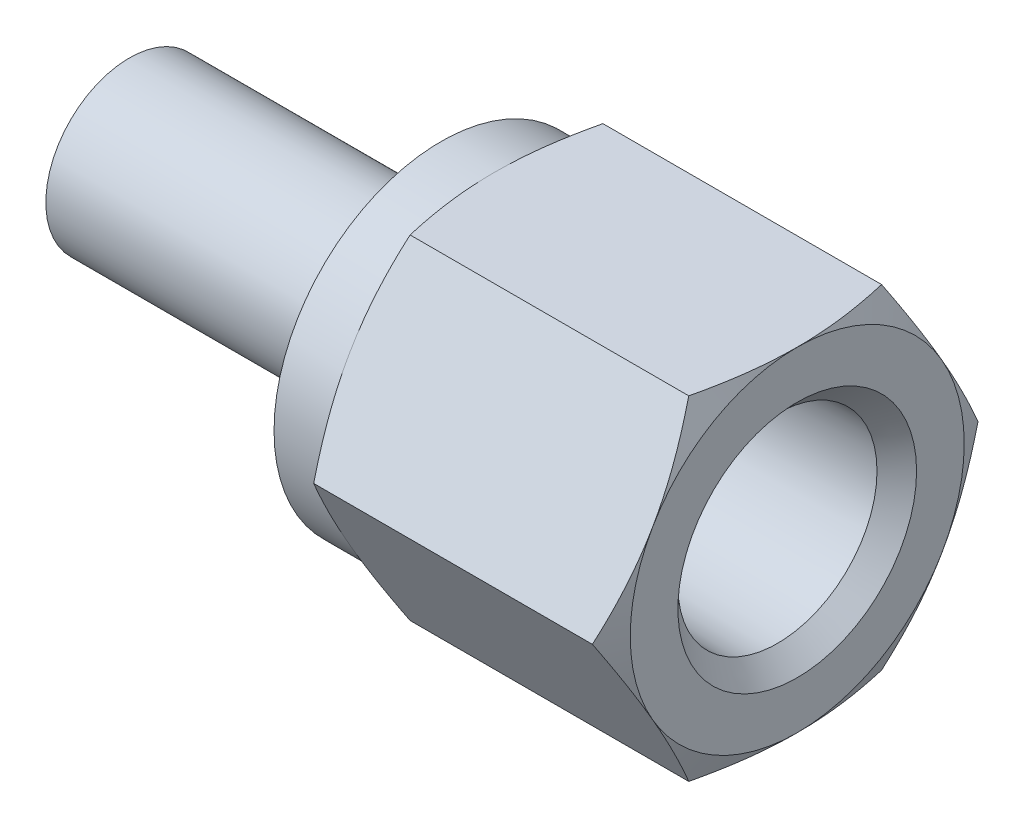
ISO-10303-21;
HEADER;
FILE_DESCRIPTION(('STEP AP214'),'2;1');
FILE_NAME('part.step','',(''),(''),'','','');
FILE_SCHEMA(('AUTOMOTIVE_DESIGN { 1 0 10303 214 1 1 1 1 }'));
ENDSEC;
DATA;
#1=APPLICATION_CONTEXT('core data for automotive mechanical design processes');
#2=APPLICATION_PROTOCOL_DEFINITION('international standard','automotive_design',2000,#1);
#3=PRODUCT_CONTEXT('',#1,'mechanical');
#4=PRODUCT('Part','Part','',(#3));
#5=PRODUCT_RELATED_PRODUCT_CATEGORY('part','',(#4));
#6=PRODUCT_DEFINITION_FORMATION('','',#4);
#7=PRODUCT_DEFINITION_CONTEXT('part definition',#1,'design');
#8=PRODUCT_DEFINITION('design','',#6,#7);
#9=PRODUCT_DEFINITION_SHAPE('','',#8);
#10=(LENGTH_UNIT() NAMED_UNIT(*) SI_UNIT(.MILLI.,.METRE.));
#11=(NAMED_UNIT(*) PLANE_ANGLE_UNIT() SI_UNIT($,.RADIAN.));
#12=(NAMED_UNIT(*) SI_UNIT($,.STERADIAN.) SOLID_ANGLE_UNIT());
#13=UNCERTAINTY_MEASURE_WITH_UNIT(LENGTH_MEASURE(1.E-05),#10,'distance_accuracy_value','');
#14=(GEOMETRIC_REPRESENTATION_CONTEXT(3) GLOBAL_UNCERTAINTY_ASSIGNED_CONTEXT((#13)) GLOBAL_UNIT_ASSIGNED_CONTEXT((#10,
#11,#12)) REPRESENTATION_CONTEXT('',''));
#15=CARTESIAN_POINT('',(0.,0.,0.));
#16=DIRECTION('',(0.,0.,1.));
#17=DIRECTION('',(1.,0.,0.));
#18=AXIS2_PLACEMENT_3D('',#15,#16,#17);
#19=CARTESIAN_POINT('',(38.0999999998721,0.,0.));
#20=DIRECTION('',(1.,0.,0.));
#21=DIRECTION('',(0.,0.,-1.));
#22=AXIS2_PLACEMENT_3D('',#19,#20,#21);
#23=CONICAL_SURFACE('',#22,6.80808899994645,0.785398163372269);
#24=CARTESIAN_POINT('',(38.099999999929,0.,0.));
#25=DIRECTION('',(1.,0.,0.));
#26=DIRECTION('',(0.,0.,-1.));
#27=AXIS2_PLACEMENT_3D('',#24,#25,#26);
#28=CIRCLE('',#27,6.80808900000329);
#29=CARTESIAN_POINT('',(38.099999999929,0.,-6.80808900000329));
#30=VERTEX_POINT('',#29);
#31=EDGE_CURVE('E19',#30,#30,#28,.T.);
#32=ORIENTED_EDGE('',*,*,#31,.T.);
#33=EDGE_LOOP('',(#32));
#34=FACE_BOUND('',#33,.T.);
#35=CARTESIAN_POINT('',(36.9712240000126,0.,0.));
#36=DIRECTION('',(1.,0.,0.));
#37=DIRECTION('',(0.,0.,-1.));
#38=AXIS2_PLACEMENT_3D('',#35,#36,#37);
#39=CIRCLE('',#38,5.67931299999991);
#40=CARTESIAN_POINT('',(36.9712240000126,0.,-5.67931299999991));
#41=VERTEX_POINT('',#40);
#42=EDGE_CURVE('E124',#41,#41,#39,.F.);
#43=ORIENTED_EDGE('',*,*,#42,.T.);
#44=EDGE_LOOP('',(#43));
#45=FACE_BOUND('',#44,.T.);
#46=ADVANCED_FACE('F16',(#34,#45),#23,.F.);
#47=CARTESIAN_POINT('',(38.1,0.,0.));
#48=DIRECTION('',(-1.,0.,0.));
#49=DIRECTION('',(0.,-1.,0.));
#50=AXIS2_PLACEMENT_3D('',#47,#48,#49);
#51=PLANE('',#50);
#52=CARTESIAN_POINT('',(38.1,0.,0.));
#53=DIRECTION('',(-1.,0.,0.));
#54=DIRECTION('',(0.,-1.,0.));
#55=AXIS2_PLACEMENT_3D('',#52,#53,#54);
#56=CIRCLE('',#55,9.525);
#57=CARTESIAN_POINT('',(38.1,-4.7625,8.24889197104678));
#58=VERTEX_POINT('',#57);
#59=CARTESIAN_POINT('',(38.1,-9.525,0.));
#60=VERTEX_POINT('',#59);
#61=EDGE_CURVE('E106',#58,#60,#56,.F.);
#62=ORIENTED_EDGE('',*,*,#61,.T.);
#63=CARTESIAN_POINT('',(38.1,0.,0.));
#64=DIRECTION('',(-1.,0.,0.));
#65=DIRECTION('',(0.,-1.,0.));
#66=AXIS2_PLACEMENT_3D('',#63,#64,#65);
#67=CIRCLE('',#66,9.525);
#68=CARTESIAN_POINT('',(38.1,-4.7625,-8.24889197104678));
#69=VERTEX_POINT('',#68);
#70=EDGE_CURVE('E469',#60,#69,#67,.F.);
#71=ORIENTED_EDGE('',*,*,#70,.T.);
#72=CARTESIAN_POINT('',(38.1,0.,0.));
#73=DIRECTION('',(-1.,0.,0.));
#74=DIRECTION('',(0.,-1.,0.));
#75=AXIS2_PLACEMENT_3D('',#72,#73,#74);
#76=CIRCLE('',#75,9.52500000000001);
#77=CARTESIAN_POINT('',(38.1,4.76250000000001,-8.24889197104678));
#78=VERTEX_POINT('',#77);
#79=EDGE_CURVE('E471',#69,#78,#76,.F.);
#80=ORIENTED_EDGE('',*,*,#79,.T.);
#81=CARTESIAN_POINT('',(38.1,0.,0.));
#82=DIRECTION('',(-1.,0.,0.));
#83=DIRECTION('',(0.,-1.,0.));
#84=AXIS2_PLACEMENT_3D('',#81,#82,#83);
#85=CIRCLE('',#84,9.525);
#86=CARTESIAN_POINT('',(38.1,9.525,0.));
#87=VERTEX_POINT('',#86);
#88=EDGE_CURVE('E397',#78,#87,#85,.F.);
#89=ORIENTED_EDGE('',*,*,#88,.T.);
#90=CARTESIAN_POINT('',(38.1,0.,0.));
#91=DIRECTION('',(-1.,0.,0.));
#92=DIRECTION('',(0.,-1.,0.));
#93=AXIS2_PLACEMENT_3D('',#90,#91,#92);
#94=CIRCLE('',#93,9.525);
#95=CARTESIAN_POINT('',(38.1,4.7625,8.24889197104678));
#96=VERTEX_POINT('',#95);
#97=EDGE_CURVE('E109',#87,#96,#94,.F.);
#98=ORIENTED_EDGE('',*,*,#97,.T.);
#99=CARTESIAN_POINT('',(38.1,0.,0.));
#100=DIRECTION('',(-1.,0.,0.));
#101=DIRECTION('',(0.,-1.,0.));
#102=AXIS2_PLACEMENT_3D('',#99,#100,#101);
#103=CIRCLE('',#102,9.525);
#104=EDGE_CURVE('E102',#96,#58,#103,.F.);
#105=ORIENTED_EDGE('',*,*,#104,.T.);
#106=EDGE_LOOP('',(#62,#71,#80,#89,#98,#105));
#107=FACE_BOUND('',#106,.T.);
#108=ORIENTED_EDGE('',*,*,#31,.F.);
#109=EDGE_LOOP('',(#108));
#110=FACE_BOUND('',#109,.T.);
#111=ADVANCED_FACE('F104',(#107,#110),#51,.F.);
#112=CARTESIAN_POINT('',(36.9712240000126,0.,0.));
#113=DIRECTION('',(1.,0.,0.));
#114=DIRECTION('',(0.,0.,-1.));
#115=AXIS2_PLACEMENT_3D('',#112,#113,#114);
#116=CONICAL_SURFACE('',#115,5.67931299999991,0.0256563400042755);
#117=ORIENTED_EDGE('',*,*,#42,.F.);
#118=EDGE_LOOP('',(#117));
#119=FACE_BOUND('',#118,.T.);
#120=CARTESIAN_POINT('',(28.0796999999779,0.,0.));
#121=DIRECTION('',(1.,0.,0.));
#122=DIRECTION('',(0.,0.,-1.));
#123=AXIS2_PLACEMENT_3D('',#120,#121,#122);
#124=CIRCLE('',#123,5.45113896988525);
#125=CARTESIAN_POINT('',(28.0796999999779,0.,-5.45113896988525));
#126=VERTEX_POINT('',#125);
#127=EDGE_CURVE('E466',#126,#126,#124,.F.);
#128=ORIENTED_EDGE('',*,*,#127,.T.);
#129=EDGE_LOOP('',(#128));
#130=FACE_BOUND('',#129,.T.);
#131=ADVANCED_FACE('F696',(#119,#130),#116,.F.);
#132=CARTESIAN_POINT('',(38.1,0.,0.));
#133=DIRECTION('',(-1.,0.,0.));
#134=DIRECTION('',(0.,-1.,0.));
#135=AXIS2_PLACEMENT_3D('',#132,#133,#134);
#136=CONICAL_SURFACE('',#135,9.525,1.13446401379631);
#137=ORIENTED_EDGE('',*,*,#61,.F.);
#138=CARTESIAN_POINT('',(37.4128851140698,-9.525,5.49926131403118));
#139=CARTESIAN_POINT('',(37.5181207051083,-9.13425586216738,5.72485754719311));
#140=CARTESIAN_POINT('',(37.6141598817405,-8.74140643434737,5.95166927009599));
#141=CARTESIAN_POINT('',(37.783216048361,-7.95340642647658,6.40662128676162));
#142=CARTESIAN_POINT('',(37.8563093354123,-7.55826801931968,6.63475455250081));
#143=CARTESIAN_POINT('',(37.9458100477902,-6.9631220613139,6.97836223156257));
#144=CARTESIAN_POINT('',(37.9722940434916,-6.7642487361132,7.09318179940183));
#145=CARTESIAN_POINT('',(38.018085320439,-6.3658813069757,7.32317934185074));
#146=CARTESIAN_POINT('',(38.0373927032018,-6.16638721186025,7.43835731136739));
#147=CARTESIAN_POINT('',(38.0685075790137,-5.76628908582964,7.66935407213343));
#148=CARTESIAN_POINT('',(38.0802898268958,-5.56568357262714,7.78517371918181));
#149=CARTESIAN_POINT('',(38.0960502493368,-5.16422061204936,8.01695846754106));
#150=CARTESIAN_POINT('',(38.1000275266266,-4.96336313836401,8.13292358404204));
#151=CARTESIAN_POINT('',(38.1,-4.7625,8.24889197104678));
#152=B_SPLINE_CURVE_WITH_KNOTS('',3,(#138,#139,#140,#141,#142,#143,#144,#145,#146,#147,#148,
#149,#150,#151),.UNSPECIFIED.,.F.,.F.,(4,2,2,2,2,2,4),(0.,1.39025784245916,2.77584275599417,
3.46922419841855,4.16259583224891,4.85828152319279,5.55404718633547),.UNSPECIFIED.);
#153=CARTESIAN_POINT('',(37.4128851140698,-9.525,5.49926131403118));
#154=VERTEX_POINT('',#153);
#155=EDGE_CURVE('E120',#154,#58,#152,.T.);
#156=ORIENTED_EDGE('',*,*,#155,.F.);
#157=CARTESIAN_POINT('',(38.1,-9.525,0.));
#158=CARTESIAN_POINT('',(38.1000275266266,-9.525,0.231936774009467));
#159=CARTESIAN_POINT('',(38.0960502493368,-9.525,0.463867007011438));
#160=CARTESIAN_POINT('',(38.0802898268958,-9.525,0.927436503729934));
#161=CARTESIAN_POINT('',(38.0685075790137,-9.525,1.1590757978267));
#162=CARTESIAN_POINT('',(38.0373927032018,-9.525,1.62106931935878));
#163=CARTESIAN_POINT('',(38.018085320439,-9.525,1.85142525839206));
#164=CARTESIAN_POINT('',(37.9722940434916,-9.525,2.31142034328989));
#165=CARTESIAN_POINT('',(37.9458100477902,-9.525,2.54105947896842));
#166=CARTESIAN_POINT('',(37.8563093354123,-9.525,3.22827483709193));
#167=CARTESIAN_POINT('',(37.783216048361,-9.525,3.68454136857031));
#168=CARTESIAN_POINT('',(37.6141598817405,-9.525,4.59444540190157));
#169=CARTESIAN_POINT('',(37.5181207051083,-9.525,5.04806884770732));
#170=CARTESIAN_POINT('',(37.4128851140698,-9.525,5.49926131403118));
#171=B_SPLINE_CURVE_WITH_KNOTS('',3,(#157,#158,#159,#160,#161,#162,#163,#164,#165,#166,#167,
#168,#169,#170),.UNSPECIFIED.,.F.,.F.,(4,2,2,2,2,2,4),(0.,0.695765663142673,1.39145135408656,
2.08482298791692,2.77820443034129,4.1637893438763,5.55404718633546),.UNSPECIFIED.);
#172=EDGE_CURVE('E122',#60,#154,#171,.T.);
#173=ORIENTED_EDGE('',*,*,#172,.F.);
#174=EDGE_LOOP('',(#137,#156,#173));
#175=FACE_BOUND('',#174,.T.);
#176=ADVANCED_FACE('F118',(#175),#136,.T.);
#177=CARTESIAN_POINT('',(38.1,0.,0.));
#178=DIRECTION('',(-1.,0.,0.));
#179=DIRECTION('',(0.,-1.,0.));
#180=AXIS2_PLACEMENT_3D('',#177,#178,#179);
#181=CONICAL_SURFACE('',#180,9.525,1.13446401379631);
#182=ORIENTED_EDGE('',*,*,#104,.F.);
#183=CARTESIAN_POINT('',(37.4128851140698,0.,10.9985226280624));
#184=CARTESIAN_POINT('',(37.5181207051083,0.390744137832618,10.7729263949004));
#185=CARTESIAN_POINT('',(37.6141598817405,0.783593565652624,10.5461146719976));
#186=CARTESIAN_POINT('',(37.783216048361,1.57159357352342,10.0911626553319));
#187=CARTESIAN_POINT('',(37.8563093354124,1.96673198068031,9.86302938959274));
#188=CARTESIAN_POINT('',(37.9458100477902,2.56187793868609,9.51942171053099));
#189=CARTESIAN_POINT('',(37.9722940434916,2.7607512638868,9.40460214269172));
#190=CARTESIAN_POINT('',(38.018085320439,3.1591186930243,9.17460460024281));
#191=CARTESIAN_POINT('',(38.0373927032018,3.35861278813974,9.05942663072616));
#192=CARTESIAN_POINT('',(38.0685075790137,3.75871091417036,8.82842986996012));
#193=CARTESIAN_POINT('',(38.0802898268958,3.95931642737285,8.71261022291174));
#194=CARTESIAN_POINT('',(38.0960502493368,4.36077938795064,8.48082547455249));
#195=CARTESIAN_POINT('',(38.1000275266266,4.56163686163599,8.36486035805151));
#196=CARTESIAN_POINT('',(38.1,4.7625,8.24889197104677));
#197=B_SPLINE_CURVE_WITH_KNOTS('',3,(#183,#184,#185,#186,#187,#188,#189,#190,#191,#192,#193,
#194,#195,#196),.UNSPECIFIED.,.F.,.F.,(4,2,2,2,2,2,4),(0.,1.39025784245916,2.77584275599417,
3.46922419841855,4.16259583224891,4.85828152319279,5.55404718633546),.UNSPECIFIED.);
#198=CARTESIAN_POINT('',(37.4128851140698,0.,10.9985226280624));
#199=VERTEX_POINT('',#198);
#200=EDGE_CURVE('E128',#199,#96,#197,.T.);
#201=ORIENTED_EDGE('',*,*,#200,.F.);
#202=CARTESIAN_POINT('',(38.1,-4.7625,8.24889197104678));
#203=CARTESIAN_POINT('',(38.1000275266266,-4.56163686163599,8.36486035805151));
#204=CARTESIAN_POINT('',(38.0960502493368,-4.36077938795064,8.4808254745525));
#205=CARTESIAN_POINT('',(38.0802898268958,-3.95931642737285,8.71261022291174));
#206=CARTESIAN_POINT('',(38.0685075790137,-3.75871091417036,8.82842986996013));
#207=CARTESIAN_POINT('',(38.0373927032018,-3.35861278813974,9.05942663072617));
#208=CARTESIAN_POINT('',(38.018085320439,-3.1591186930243,9.17460460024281));
#209=CARTESIAN_POINT('',(37.9722940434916,-2.7607512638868,9.40460214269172));
#210=CARTESIAN_POINT('',(37.9458100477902,-2.5618779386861,9.51942171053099));
#211=CARTESIAN_POINT('',(37.8563093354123,-1.96673198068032,9.86302938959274));
#212=CARTESIAN_POINT('',(37.783216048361,-1.57159357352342,10.0911626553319));
#213=CARTESIAN_POINT('',(37.6141598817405,-0.783593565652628,10.5461146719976));
#214=CARTESIAN_POINT('',(37.5181207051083,-0.390744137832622,10.7729263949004));
#215=CARTESIAN_POINT('',(37.4128851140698,0.,10.9985226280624));
#216=B_SPLINE_CURVE_WITH_KNOTS('',3,(#202,#203,#204,#205,#206,#207,#208,#209,#210,#211,#212,
#213,#214,#215),.UNSPECIFIED.,.F.,.F.,(4,2,2,2,2,2,4),(0.,0.695765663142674,1.39145135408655,
2.08482298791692,2.77820443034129,4.1637893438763,5.55404718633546),.UNSPECIFIED.);
#217=EDGE_CURVE('E125',#58,#199,#216,.T.);
#218=ORIENTED_EDGE('',*,*,#217,.F.);
#219=EDGE_LOOP('',(#182,#201,#218));
#220=FACE_BOUND('',#219,.T.);
#221=ADVANCED_FACE('F126',(#220),#181,.T.);
#222=CARTESIAN_POINT('',(38.1,0.,0.));
#223=DIRECTION('',(-1.,0.,0.));
#224=DIRECTION('',(0.,-1.,0.));
#225=AXIS2_PLACEMENT_3D('',#222,#223,#224);
#226=CONICAL_SURFACE('',#225,9.525,1.13446401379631);
#227=CARTESIAN_POINT('',(38.1,4.7625,8.24889197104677));
#228=CARTESIAN_POINT('',(38.1000275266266,4.96336313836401,8.13292358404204));
#229=CARTESIAN_POINT('',(38.0960502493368,5.16422061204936,8.01695846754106));
#230=CARTESIAN_POINT('',(38.0802898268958,5.56568357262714,7.78517371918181));
#231=CARTESIAN_POINT('',(38.0685075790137,5.76628908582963,7.66935407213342));
#232=CARTESIAN_POINT('',(38.0373927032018,6.16638721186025,7.43835731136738));
#233=CARTESIAN_POINT('',(38.018085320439,6.36588130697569,7.32317934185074));
#234=CARTESIAN_POINT('',(37.9722940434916,6.76424873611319,7.09318179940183));
#235=CARTESIAN_POINT('',(37.9458100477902,6.9631220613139,6.97836223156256));
#236=CARTESIAN_POINT('',(37.8563093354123,7.55826801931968,6.63475455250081));
#237=CARTESIAN_POINT('',(37.783216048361,7.95340642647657,6.40662128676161));
#238=CARTESIAN_POINT('',(37.6141598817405,8.74140643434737,5.95166927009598));
#239=CARTESIAN_POINT('',(37.5181207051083,9.13425586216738,5.72485754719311));
#240=CARTESIAN_POINT('',(37.4128851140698,9.52499999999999,5.49926131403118));
#241=B_SPLINE_CURVE_WITH_KNOTS('',3,(#227,#228,#229,#230,#231,#232,#233,#234,#235,#236,#237,
#238,#239,#240),.UNSPECIFIED.,.F.,.F.,(4,2,2,2,2,2,4),(0.,0.695765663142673,1.39145135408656,
2.08482298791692,2.77820443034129,4.1637893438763,5.55404718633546),.UNSPECIFIED.);
#242=CARTESIAN_POINT('',(37.4128851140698,9.52499999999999,5.49926131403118));
#243=VERTEX_POINT('',#242);
#244=EDGE_CURVE('E333',#96,#243,#241,.T.);
#245=ORIENTED_EDGE('',*,*,#244,.F.);
#246=ORIENTED_EDGE('',*,*,#97,.F.);
#247=CARTESIAN_POINT('',(37.4128851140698,9.52499999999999,5.49926131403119));
#248=CARTESIAN_POINT('',(37.5181207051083,9.52499999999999,5.04806884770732));
#249=CARTESIAN_POINT('',(37.6141598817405,9.52499999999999,4.59444540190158));
#250=CARTESIAN_POINT('',(37.783216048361,9.52499999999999,3.68454136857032));
#251=CARTESIAN_POINT('',(37.8563093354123,9.52499999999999,3.22827483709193));
#252=CARTESIAN_POINT('',(37.9458100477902,9.52499999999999,2.54105947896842));
#253=CARTESIAN_POINT('',(37.9722940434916,9.52499999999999,2.3114203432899));
#254=CARTESIAN_POINT('',(38.018085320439,9.52499999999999,1.85142525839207));
#255=CARTESIAN_POINT('',(38.0373927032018,9.52499999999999,1.62106931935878));
#256=CARTESIAN_POINT('',(38.0685075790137,9.52499999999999,1.1590757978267));
#257=CARTESIAN_POINT('',(38.0802898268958,9.52499999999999,0.927436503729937));
#258=CARTESIAN_POINT('',(38.0960502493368,9.52499999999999,0.46386700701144));
#259=CARTESIAN_POINT('',(38.1000275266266,9.52499999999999,0.231936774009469));
#260=CARTESIAN_POINT('',(38.1,9.52499999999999,0.));
#261=B_SPLINE_CURVE_WITH_KNOTS('',3,(#247,#248,#249,#250,#251,#252,#253,#254,#255,#256,#257,
#258,#259,#260),.UNSPECIFIED.,.F.,.F.,(4,2,2,2,2,2,4),(0.,1.39025784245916,2.77584275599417,
3.46922419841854,4.16259583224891,4.85828152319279,5.55404718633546),.UNSPECIFIED.);
#262=EDGE_CURVE('E310',#243,#87,#261,.T.);
#263=ORIENTED_EDGE('',*,*,#262,.F.);
#264=EDGE_LOOP('',(#245,#246,#263));
#265=FACE_BOUND('',#264,.T.);
#266=ADVANCED_FACE('F324',(#265),#226,.T.);
#267=CARTESIAN_POINT('',(38.1,0.,0.));
#268=DIRECTION('',(-1.,0.,0.));
#269=DIRECTION('',(0.,-1.,0.));
#270=AXIS2_PLACEMENT_3D('',#267,#268,#269);
#271=CONICAL_SURFACE('',#270,9.525,1.13446401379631);
#272=CARTESIAN_POINT('',(38.1,9.52499999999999,0.));
#273=CARTESIAN_POINT('',(38.1000275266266,9.52499999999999,-0.231936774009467));
#274=CARTESIAN_POINT('',(38.0960502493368,9.52499999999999,-0.463867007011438));
#275=CARTESIAN_POINT('',(38.0802898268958,9.52499999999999,-0.927436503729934));
#276=CARTESIAN_POINT('',(38.0685075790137,9.52499999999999,-1.1590757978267));
#277=CARTESIAN_POINT('',(38.0373927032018,9.52499999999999,-1.62106931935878));
#278=CARTESIAN_POINT('',(38.018085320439,9.52499999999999,-1.85142525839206));
#279=CARTESIAN_POINT('',(37.9722940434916,9.52499999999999,-2.31142034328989));
#280=CARTESIAN_POINT('',(37.9458100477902,9.52499999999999,-2.54105947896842));
#281=CARTESIAN_POINT('',(37.8563093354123,9.52499999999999,-3.22827483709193));
#282=CARTESIAN_POINT('',(37.783216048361,9.52499999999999,-3.68454136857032));
#283=CARTESIAN_POINT('',(37.6141598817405,9.52499999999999,-4.59444540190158));
#284=CARTESIAN_POINT('',(37.5181207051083,9.52499999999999,-5.04806884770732));
#285=CARTESIAN_POINT('',(37.4128851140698,9.52499999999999,-5.49926131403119));
#286=B_SPLINE_CURVE_WITH_KNOTS('',3,(#272,#273,#274,#275,#276,#277,#278,#279,#280,#281,#282,
#283,#284,#285),.UNSPECIFIED.,.F.,.F.,(4,2,2,2,2,2,4),(0.,0.695765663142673,1.39145135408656,
2.08482298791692,2.77820443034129,4.1637893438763,5.55404718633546),.UNSPECIFIED.);
#287=CARTESIAN_POINT('',(37.4128851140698,9.525,-5.49926131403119));
#288=VERTEX_POINT('',#287);
#289=EDGE_CURVE('E303',#87,#288,#286,.T.);
#290=ORIENTED_EDGE('',*,*,#289,.F.);
#291=ORIENTED_EDGE('',*,*,#88,.F.);
#292=CARTESIAN_POINT('',(37.4128851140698,9.52499999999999,-5.49926131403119));
#293=CARTESIAN_POINT('',(37.5181207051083,9.13425586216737,-5.72485754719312));
#294=CARTESIAN_POINT('',(37.6141598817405,8.74140643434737,-5.95166927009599));
#295=CARTESIAN_POINT('',(37.783216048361,7.95340642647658,-6.40662128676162));
#296=CARTESIAN_POINT('',(37.8563093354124,7.55826801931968,-6.63475455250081));
#297=CARTESIAN_POINT('',(37.9458100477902,6.96312206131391,-6.97836223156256));
#298=CARTESIAN_POINT('',(37.9722940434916,6.7642487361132,-7.09318179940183));
#299=CARTESIAN_POINT('',(38.018085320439,6.3658813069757,-7.32317934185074));
#300=CARTESIAN_POINT('',(38.0373927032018,6.16638721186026,-7.43835731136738));
#301=CARTESIAN_POINT('',(38.0685075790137,5.76628908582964,-7.66935407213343));
#302=CARTESIAN_POINT('',(38.0802898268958,5.56568357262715,-7.78517371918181));
#303=CARTESIAN_POINT('',(38.0960502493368,5.16422061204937,-8.01695846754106));
#304=CARTESIAN_POINT('',(38.1000275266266,4.96336313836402,-8.13292358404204));
#305=CARTESIAN_POINT('',(38.1,4.76250000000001,-8.24889197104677));
#306=B_SPLINE_CURVE_WITH_KNOTS('',3,(#292,#293,#294,#295,#296,#297,#298,#299,#300,#301,#302,
#303,#304,#305),.UNSPECIFIED.,.F.,.F.,(4,2,2,2,2,2,4),(0.,1.39025784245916,2.77584275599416,
3.46922419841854,4.1625958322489,4.85828152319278,5.55404718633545),.UNSPECIFIED.);
#307=EDGE_CURVE('E311',#288,#78,#306,.T.);
#308=ORIENTED_EDGE('',*,*,#307,.F.);
#309=EDGE_LOOP('',(#290,#291,#308));
#310=FACE_BOUND('',#309,.T.);
#311=ADVANCED_FACE('F320',(#310),#271,.T.);
#312=CARTESIAN_POINT('',(38.1,0.,0.));
#313=DIRECTION('',(-1.,0.,0.));
#314=DIRECTION('',(0.,-1.,0.));
#315=AXIS2_PLACEMENT_3D('',#312,#313,#314);
#316=CONICAL_SURFACE('',#315,9.525,1.13446401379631);
#317=ORIENTED_EDGE('',*,*,#79,.F.);
#318=CARTESIAN_POINT('',(37.4128851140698,0.,-10.9985226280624));
#319=CARTESIAN_POINT('',(37.5181207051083,-0.390744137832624,-10.7729263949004));
#320=CARTESIAN_POINT('',(37.6141598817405,-0.78359356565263,-10.5461146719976));
#321=CARTESIAN_POINT('',(37.783216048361,-1.57159357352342,-10.0911626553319));
#322=CARTESIAN_POINT('',(37.8563093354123,-1.96673198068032,-9.86302938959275));
#323=CARTESIAN_POINT('',(37.9458100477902,-2.5618779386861,-9.51942171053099));
#324=CARTESIAN_POINT('',(37.9722940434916,-2.7607512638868,-9.40460214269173));
#325=CARTESIAN_POINT('',(38.018085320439,-3.1591186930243,-9.17460460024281));
#326=CARTESIAN_POINT('',(38.0373927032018,-3.35861278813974,-9.05942663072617));
#327=CARTESIAN_POINT('',(38.0685075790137,-3.75871091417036,-8.82842986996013));
#328=CARTESIAN_POINT('',(38.0802898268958,-3.95931642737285,-8.71261022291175));
#329=CARTESIAN_POINT('',(38.0960502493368,-4.36077938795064,-8.4808254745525));
#330=CARTESIAN_POINT('',(38.1000275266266,-4.56163686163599,-8.36486035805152));
#331=CARTESIAN_POINT('',(38.1,-4.7625,-8.24889197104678));
#332=B_SPLINE_CURVE_WITH_KNOTS('',3,(#318,#319,#320,#321,#322,#323,#324,#325,#326,#327,#328,
#329,#330,#331),.UNSPECIFIED.,.F.,.F.,(4,2,2,2,2,2,4),(0.,1.39025784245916,2.77584275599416,
3.46922419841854,4.1625958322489,4.85828152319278,5.55404718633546),.UNSPECIFIED.);
#333=CARTESIAN_POINT('',(37.4128851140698,0.,-10.9985226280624));
#334=VERTEX_POINT('',#333);
#335=EDGE_CURVE('E226',#334,#69,#332,.T.);
#336=ORIENTED_EDGE('',*,*,#335,.F.);
#337=CARTESIAN_POINT('',(38.1,4.76250000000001,-8.24889197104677));
#338=CARTESIAN_POINT('',(38.1000275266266,4.561636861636,-8.36486035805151));
#339=CARTESIAN_POINT('',(38.0960502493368,4.36077938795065,-8.48082547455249));
#340=CARTESIAN_POINT('',(38.0802898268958,3.95931642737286,-8.71261022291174));
#341=CARTESIAN_POINT('',(38.0685075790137,3.75871091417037,-8.82842986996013));
#342=CARTESIAN_POINT('',(38.0373927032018,3.35861278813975,-9.05942663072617));
#343=CARTESIAN_POINT('',(38.018085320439,3.15911869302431,-9.17460460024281));
#344=CARTESIAN_POINT('',(37.9722940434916,2.76075126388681,-9.40460214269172));
#345=CARTESIAN_POINT('',(37.9458100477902,2.5618779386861,-9.51942171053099));
#346=CARTESIAN_POINT('',(37.8563093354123,1.96673198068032,-9.86302938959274));
#347=CARTESIAN_POINT('',(37.783216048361,1.57159357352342,-10.0911626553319));
#348=CARTESIAN_POINT('',(37.6141598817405,0.78359356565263,-10.5461146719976));
#349=CARTESIAN_POINT('',(37.5181207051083,0.390744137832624,-10.7729263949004));
#350=CARTESIAN_POINT('',(37.4128851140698,0.,-10.9985226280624));
#351=B_SPLINE_CURVE_WITH_KNOTS('',3,(#337,#338,#339,#340,#341,#342,#343,#344,#345,#346,#347,
#348,#349,#350),.UNSPECIFIED.,.F.,.F.,(4,2,2,2,2,2,4),(0.,0.695765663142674,1.39145135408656,
2.08482298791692,2.7782044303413,4.16378934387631,5.55404718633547),.UNSPECIFIED.);
#352=EDGE_CURVE('E387',#78,#334,#351,.T.);
#353=ORIENTED_EDGE('',*,*,#352,.F.);
#354=EDGE_LOOP('',(#317,#336,#353));
#355=FACE_BOUND('',#354,.T.);
#356=ADVANCED_FACE('F323',(#355),#316,.T.);
#357=CARTESIAN_POINT('',(38.1,0.,0.));
#358=DIRECTION('',(-1.,0.,0.));
#359=DIRECTION('',(0.,-1.,0.));
#360=AXIS2_PLACEMENT_3D('',#357,#358,#359);
#361=CONICAL_SURFACE('',#360,9.525,1.13446401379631);
#362=ORIENTED_EDGE('',*,*,#70,.F.);
#363=CARTESIAN_POINT('',(37.4128851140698,-9.525,-5.49926131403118));
#364=CARTESIAN_POINT('',(37.5181207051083,-9.525,-5.04806884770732));
#365=CARTESIAN_POINT('',(37.6141598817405,-9.525,-4.59444540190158));
#366=CARTESIAN_POINT('',(37.783216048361,-9.525,-3.68454136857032));
#367=CARTESIAN_POINT('',(37.8563093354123,-9.525,-3.22827483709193));
#368=CARTESIAN_POINT('',(37.9458100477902,-9.525,-2.54105947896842));
#369=CARTESIAN_POINT('',(37.9722940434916,-9.525,-2.3114203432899));
#370=CARTESIAN_POINT('',(38.018085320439,-9.525,-1.85142525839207));
#371=CARTESIAN_POINT('',(38.0373927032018,-9.525,-1.62106931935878));
#372=CARTESIAN_POINT('',(38.0685075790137,-9.525,-1.1590757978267));
#373=CARTESIAN_POINT('',(38.0802898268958,-9.525,-0.927436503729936));
#374=CARTESIAN_POINT('',(38.0960502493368,-9.525,-0.46386700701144));
#375=CARTESIAN_POINT('',(38.1000275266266,-9.525,-0.231936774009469));
#376=CARTESIAN_POINT('',(38.1,-9.525,0.));
#377=B_SPLINE_CURVE_WITH_KNOTS('',3,(#363,#364,#365,#366,#367,#368,#369,#370,#371,#372,#373,
#374,#375,#376),.UNSPECIFIED.,.F.,.F.,(4,2,2,2,2,2,4),(0.,1.39025784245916,2.77584275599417,
3.46922419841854,4.1625958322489,4.85828152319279,5.55404718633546),.UNSPECIFIED.);
#378=CARTESIAN_POINT('',(37.4128851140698,-9.525,-5.49926131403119));
#379=VERTEX_POINT('',#378);
#380=EDGE_CURVE('E468',#379,#60,#377,.T.);
#381=ORIENTED_EDGE('',*,*,#380,.F.);
#382=CARTESIAN_POINT('',(38.1,-4.7625,-8.24889197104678));
#383=CARTESIAN_POINT('',(38.1000275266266,-4.96336313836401,-8.13292358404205));
#384=CARTESIAN_POINT('',(38.0960502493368,-5.16422061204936,-8.01695846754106));
#385=CARTESIAN_POINT('',(38.0802898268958,-5.56568357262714,-7.78517371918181));
#386=CARTESIAN_POINT('',(38.0685075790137,-5.76628908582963,-7.66935407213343));
#387=CARTESIAN_POINT('',(38.0373927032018,-6.16638721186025,-7.43835731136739));
#388=CARTESIAN_POINT('',(38.018085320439,-6.36588130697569,-7.32317934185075));
#389=CARTESIAN_POINT('',(37.9722940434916,-6.76424873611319,-7.09318179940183));
#390=CARTESIAN_POINT('',(37.9458100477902,-6.9631220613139,-6.97836223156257));
#391=CARTESIAN_POINT('',(37.8563093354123,-7.55826801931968,-6.63475455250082));
#392=CARTESIAN_POINT('',(37.783216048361,-7.95340642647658,-6.40662128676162));
#393=CARTESIAN_POINT('',(37.6141598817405,-8.74140643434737,-5.95166927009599));
#394=CARTESIAN_POINT('',(37.5181207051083,-9.13425586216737,-5.72485754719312));
#395=CARTESIAN_POINT('',(37.4128851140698,-9.525,-5.49926131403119));
#396=B_SPLINE_CURVE_WITH_KNOTS('',3,(#382,#383,#384,#385,#386,#387,#388,#389,#390,#391,#392,
#393,#394,#395),.UNSPECIFIED.,.F.,.F.,(4,2,2,2,2,2,4),(0.,0.695765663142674,1.39145135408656,
2.08482298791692,2.77820443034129,4.1637893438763,5.55404718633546),.UNSPECIFIED.);
#397=EDGE_CURVE('E219',#69,#379,#396,.T.);
#398=ORIENTED_EDGE('',*,*,#397,.F.);
#399=EDGE_LOOP('',(#362,#381,#398));
#400=FACE_BOUND('',#399,.T.);
#401=ADVANCED_FACE('F232',(#400),#361,.T.);
#402=CARTESIAN_POINT('',(28.0797,0.,0.));
#403=DIRECTION('',(-1.,0.,0.));
#404=DIRECTION('',(0.,-1.,0.));
#405=AXIS2_PLACEMENT_3D('',#402,#403,#404);
#406=PLANE('',#405);
#407=CARTESIAN_POINT('',(28.0797,0.,0.));
#408=DIRECTION('',(1.,0.,0.));
#409=DIRECTION('',(0.,1.,0.));
#410=AXIS2_PLACEMENT_3D('',#407,#408,#409);
#411=CIRCLE('',#410,5.36733002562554);
#412=CARTESIAN_POINT('',(28.0797,5.36733002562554,0.));
#413=VERTEX_POINT('',#412);
#414=EDGE_CURVE('E215',#413,#413,#411,.F.);
#415=ORIENTED_EDGE('',*,*,#414,.T.);
#416=EDGE_LOOP('',(#415));
#417=FACE_BOUND('',#416,.T.);
#418=ORIENTED_EDGE('',*,*,#127,.F.);
#419=EDGE_LOOP('',(#418));
#420=FACE_BOUND('',#419,.T.);
#421=ADVANCED_FACE('F461',(#417,#420),#406,.F.);
#422=CARTESIAN_POINT('',(38.1,-9.525,0.));
#423=DIRECTION('',(0.,-1.,0.));
#424=DIRECTION('',(1.,0.,0.));
#425=AXIS2_PLACEMENT_3D('',#422,#423,#424);
#426=PLANE('',#425);
#427=DIRECTION('',(1.,0.,0.));
#428=VECTOR('',#427,1.);
#429=CARTESIAN_POINT('',(38.1,-9.525,5.49926131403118));
#430=LINE('',#429,#428);
#431=CARTESIAN_POINT('',(21.5151148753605,-9.52499996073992,5.499261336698));
#432=VERTEX_POINT('',#431);
#433=EDGE_CURVE('E135',#432,#154,#430,.T.);
#434=ORIENTED_EDGE('',*,*,#433,.F.);
#435=CARTESIAN_POINT('',(21.515114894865,-9.525,5.49926135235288));
#436=CARTESIAN_POINT('',(21.4098793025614,-9.525,5.04806888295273));
#437=CARTESIAN_POINT('',(21.3138401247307,-9.525,4.59444543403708));
#438=CARTESIAN_POINT('',(21.1447839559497,-9.525,3.68454139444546));
#439=CARTESIAN_POINT('',(21.0716906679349,-9.525,3.228274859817));
#440=CARTESIAN_POINT('',(20.9821899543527,-9.525,2.54105949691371));
#441=CARTESIAN_POINT('',(20.9557059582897,-9.525,2.31142035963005));
#442=CARTESIAN_POINT('',(20.909914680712,-9.525,1.85142527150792));
#443=CARTESIAN_POINT('',(20.8906072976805,-9.525,1.62106933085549));
#444=CARTESIAN_POINT('',(20.8594924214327,-9.525,1.15907580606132));
#445=CARTESIAN_POINT('',(20.847710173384,-9.525,0.927436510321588));
#446=CARTESIAN_POINT('',(20.8319497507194,-9.525,0.463867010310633));
#447=CARTESIAN_POINT('',(20.8279724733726,-9.525,0.231936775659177));
#448=CARTESIAN_POINT('',(20.828,-9.525,0.));
#449=B_SPLINE_CURVE_WITH_KNOTS('',3,(#435,#436,#437,#438,#439,#440,#441,#442,#443,#444,#445,
#446,#447,#448),.UNSPECIFIED.,.F.,.F.,(4,2,2,2,2,2,4),(0.,1.39025785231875,2.77584277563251,
3.46922422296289,4.16259586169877,4.85828155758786,5.55404722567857),.UNSPECIFIED.);
#450=CARTESIAN_POINT('',(20.828,-9.525,0.));
#451=VERTEX_POINT('',#450);
#452=EDGE_CURVE('E184',#432,#451,#449,.T.);
#453=ORIENTED_EDGE('',*,*,#452,.T.);
#454=CARTESIAN_POINT('',(20.828,-9.525,0.));
#455=CARTESIAN_POINT('',(20.8279724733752,-9.525,-0.23193677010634));
#456=CARTESIAN_POINT('',(20.8319497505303,-9.525,-0.46386699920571));
#457=CARTESIAN_POINT('',(20.8477101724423,-9.525,-0.927436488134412));
#458=CARTESIAN_POINT('',(20.8594924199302,-9.525,-1.15907577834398));
#459=CARTESIAN_POINT('',(20.8906072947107,-9.525,-1.62106929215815));
#460=CARTESIAN_POINT('',(20.9099146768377,-9.525,-1.85142522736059));
#461=CARTESIAN_POINT('',(20.9557059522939,-9.525,-2.3114203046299));
#462=CARTESIAN_POINT('',(20.9821899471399,-9.525,-2.54105943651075));
#463=CARTESIAN_POINT('',(21.0716906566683,-9.525,-3.22827478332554));
#464=CARTESIAN_POINT('',(21.1447839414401,-9.525,-3.684541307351));
#465=CARTESIAN_POINT('',(21.313840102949,-9.525,-4.59444532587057));
#466=CARTESIAN_POINT('',(21.4098792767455,-9.525,-5.04806876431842));
#467=CARTESIAN_POINT('',(21.5151148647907,-9.525,-5.49926122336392));
#468=B_SPLINE_CURVE_WITH_KNOTS('',3,(#454,#455,#456,#457,#458,#459,#460,#461,#462,#463,#464,
#465,#466,#467),.UNSPECIFIED.,.F.,.F.,(4,2,2,2,2,2,4),(0.,0.69576565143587,1.39145133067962,
2.08482295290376,2.77820438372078,4.16378927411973,5.55404709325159),.UNSPECIFIED.);
#469=CARTESIAN_POINT('',(21.5151148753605,-9.525,-5.49926126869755));
#470=VERTEX_POINT('',#469);
#471=EDGE_CURVE('E210',#451,#470,#468,.T.);
#472=ORIENTED_EDGE('',*,*,#471,.T.);
#473=DIRECTION('',(1.,0.,0.));
#474=VECTOR('',#473,1.);
#475=CARTESIAN_POINT('',(38.1,-9.525,-5.49926131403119));
#476=LINE('',#475,#474);
#477=EDGE_CURVE('E218',#379,#470,#476,.F.);
#478=ORIENTED_EDGE('',*,*,#477,.F.);
#479=ORIENTED_EDGE('',*,*,#380,.T.);
#480=ORIENTED_EDGE('',*,*,#172,.T.);
#481=EDGE_LOOP('',(#434,#453,#472,#478,#479,#480));
#482=FACE_BOUND('',#481,.T.);
#483=ADVANCED_FACE('F160',(#482),#426,.T.);
#484=CARTESIAN_POINT('',(38.1,0.,10.9985226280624));
#485=DIRECTION('',(0.,-0.5,0.866025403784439));
#486=DIRECTION('',(0.,-0.866025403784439,-0.5));
#487=AXIS2_PLACEMENT_3D('',#484,#485,#486);
#488=PLANE('',#487);
#489=DIRECTION('',(1.,0.,0.));
#490=VECTOR('',#489,1.);
#491=CARTESIAN_POINT('',(38.1,0.,10.9985226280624));
#492=LINE('',#491,#490);
#493=CARTESIAN_POINT('',(21.5151148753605,3.92600754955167E-08,10.9985226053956));
#494=VERTEX_POINT('',#493);
#495=EDGE_CURVE('E131',#494,#199,#492,.T.);
#496=ORIENTED_EDGE('',*,*,#495,.F.);
#497=CARTESIAN_POINT('',(21.515114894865,3.31875641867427E-08,10.9985226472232));
#498=CARTESIAN_POINT('',(21.4098793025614,-0.390744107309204,10.7729264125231));
#499=CARTESIAN_POINT('',(21.3138401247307,-0.783593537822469,10.5461146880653));
#500=CARTESIAN_POINT('',(21.1447839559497,-1.57159355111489,10.0911626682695));
#501=CARTESIAN_POINT('',(21.0716906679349,-1.96673196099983,9.86302940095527));
#502=CARTESIAN_POINT('',(20.9821899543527,-2.56187792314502,9.51942171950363));
#503=CARTESIAN_POINT('',(20.9557059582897,-2.76075124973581,9.4046021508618));
#504=CARTESIAN_POINT('',(20.909914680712,-3.15911868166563,9.17460460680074));
#505=CARTESIAN_POINT('',(20.8906072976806,-3.35861277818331,9.05942663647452));
#506=CARTESIAN_POINT('',(20.8594924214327,-3.75871090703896,8.82842987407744));
#507=CARTESIAN_POINT('',(20.847710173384,-3.95931642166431,8.71261022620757));
#508=CARTESIAN_POINT('',(20.8319497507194,-4.36077938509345,8.48082547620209));
#509=CARTESIAN_POINT('',(20.8279724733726,-4.5616368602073,8.36486035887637));
#510=CARTESIAN_POINT('',(20.828,-4.76249999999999,8.24889197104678));
#511=B_SPLINE_CURVE_WITH_KNOTS('',3,(#497,#498,#499,#500,#501,#502,#503,#504,#505,#506,#507,
#508,#509,#510),.UNSPECIFIED.,.F.,.F.,(4,2,2,2,2,2,4),(0.,1.39025785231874,2.77584277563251,
3.46922422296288,4.16259586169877,4.85828155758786,5.55404722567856),.UNSPECIFIED.);
#512=CARTESIAN_POINT('',(20.828,-4.7625,8.24889197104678));
#513=VERTEX_POINT('',#512);
#514=EDGE_CURVE('E168',#494,#513,#511,.T.);
#515=ORIENTED_EDGE('',*,*,#514,.T.);
#516=CARTESIAN_POINT('',(20.828,-4.7625,8.24889197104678));
#517=CARTESIAN_POINT('',(20.8279724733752,-4.9633631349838,8.13292358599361));
#518=CARTESIAN_POINT('',(20.8319497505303,-5.1642206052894,8.01695847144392));
#519=CARTESIAN_POINT('',(20.8477101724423,-5.56568355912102,7.78517372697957));
#520=CARTESIAN_POINT('',(20.8594924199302,-5.7662890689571,7.66935408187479));
#521=CARTESIAN_POINT('',(20.8906072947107,-6.16638718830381,7.4383573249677));
#522=CARTESIAN_POINT('',(20.9099146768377,-6.36588128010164,7.32317935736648));
#523=CARTESIAN_POINT('',(20.9557059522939,-6.76424870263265,7.09318181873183));
#524=CARTESIAN_POINT('',(20.9821899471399,-6.96312202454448,6.9783622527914));
#525=CARTESIAN_POINT('',(21.0716906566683,-7.55826797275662,6.63475457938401));
#526=CARTESIAN_POINT('',(21.1447839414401,-7.95340637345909,6.40662131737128));
#527=CARTESIAN_POINT('',(21.313840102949,-8.74140636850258,5.95166930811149));
#528=CARTESIAN_POINT('',(21.4098792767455,-9.13425578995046,5.72485758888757));
#529=CARTESIAN_POINT('',(21.5151148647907,-9.52499992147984,5.49926135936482));
#530=B_SPLINE_CURVE_WITH_KNOTS('',3,(#516,#517,#518,#519,#520,#521,#522,#523,#524,#525,#526,
#527,#528,#529),.UNSPECIFIED.,.F.,.F.,(4,2,2,2,2,2,4),(0.,0.69576565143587,1.39145133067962,
2.08482295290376,2.77820438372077,4.16378927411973,5.55404709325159),.UNSPECIFIED.);
#531=EDGE_CURVE('E177',#513,#432,#530,.T.);
#532=ORIENTED_EDGE('',*,*,#531,.T.);
#533=ORIENTED_EDGE('',*,*,#433,.T.);
#534=ORIENTED_EDGE('',*,*,#155,.T.);
#535=ORIENTED_EDGE('',*,*,#217,.T.);
#536=EDGE_LOOP('',(#496,#515,#532,#533,#534,#535));
#537=FACE_BOUND('',#536,.T.);
#538=ADVANCED_FACE('F133',(#537),#488,.T.);
#539=CARTESIAN_POINT('',(38.1,9.52499999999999,5.49926131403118));
#540=DIRECTION('',(0.,0.5,0.866025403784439));
#541=DIRECTION('',(0.,-0.866025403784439,0.5));
#542=AXIS2_PLACEMENT_3D('',#539,#540,#541);
#543=PLANE('',#542);
#544=DIRECTION('',(1.,0.,0.));
#545=VECTOR('',#544,1.);
#546=CARTESIAN_POINT('',(38.1,9.52499999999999,5.49926131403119));
#547=LINE('',#546,#545);
#548=CARTESIAN_POINT('',(21.5151148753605,9.52499999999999,5.49926126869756));
#549=VERTEX_POINT('',#548);
#550=EDGE_CURVE('E337',#549,#243,#547,.T.);
#551=ORIENTED_EDGE('',*,*,#550,.F.);
#552=CARTESIAN_POINT('',(21.515114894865,9.52500003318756,5.49926129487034));
#553=CARTESIAN_POINT('',(21.4098793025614,9.13425589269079,5.72485752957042));
#554=CARTESIAN_POINT('',(21.3138401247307,8.74140646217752,5.95166925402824));
#555=CARTESIAN_POINT('',(21.1447839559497,7.9534064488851,6.40662127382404));
#556=CARTESIAN_POINT('',(21.0716906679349,7.55826803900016,6.63475454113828));
#557=CARTESIAN_POINT('',(20.9821899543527,6.96312207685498,6.97836222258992));
#558=CARTESIAN_POINT('',(20.9557059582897,6.76424875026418,7.09318179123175));
#559=CARTESIAN_POINT('',(20.909914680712,6.36588131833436,7.32317933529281));
#560=CARTESIAN_POINT('',(20.8906072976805,6.16638722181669,7.43835730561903));
#561=CARTESIAN_POINT('',(20.8594924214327,5.76628909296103,7.66935406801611));
#562=CARTESIAN_POINT('',(20.847710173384,5.56568357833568,7.78517371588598));
#563=CARTESIAN_POINT('',(20.8319497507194,5.16422061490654,8.01695846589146));
#564=CARTESIAN_POINT('',(20.8279724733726,4.9633631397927,8.13292358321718));
#565=CARTESIAN_POINT('',(20.828,4.7625,8.24889197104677));
#566=B_SPLINE_CURVE_WITH_KNOTS('',3,(#552,#553,#554,#555,#556,#557,#558,#559,#560,#561,#562,
#563,#564,#565),.UNSPECIFIED.,.F.,.F.,(4,2,2,2,2,2,4),(0.,1.39025785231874,2.7758427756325,
3.46922422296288,4.16259586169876,4.85828155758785,5.55404722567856),.UNSPECIFIED.);
#567=CARTESIAN_POINT('',(20.828,4.7625,8.24889197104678));
#568=VERTEX_POINT('',#567);
#569=EDGE_CURVE('E286',#549,#568,#566,.T.);
#570=ORIENTED_EDGE('',*,*,#569,.T.);
#571=CARTESIAN_POINT('',(20.828,4.7625,8.24889197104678));
#572=CARTESIAN_POINT('',(20.8279724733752,4.5616368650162,8.36486035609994));
#573=CARTESIAN_POINT('',(20.8319497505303,4.3607793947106,8.48082547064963));
#574=CARTESIAN_POINT('',(20.8477101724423,3.95931644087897,8.71261021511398));
#575=CARTESIAN_POINT('',(20.8594924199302,3.75871093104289,8.82842986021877));
#576=CARTESIAN_POINT('',(20.8906072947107,3.35861281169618,9.05942661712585));
#577=CARTESIAN_POINT('',(20.9099146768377,3.15911871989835,9.17460458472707));
#578=CARTESIAN_POINT('',(20.9557059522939,2.76075129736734,9.40460212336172));
#579=CARTESIAN_POINT('',(20.9821899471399,2.56187797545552,9.51942168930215));
#580=CARTESIAN_POINT('',(21.0716906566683,1.96673202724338,9.86302936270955));
#581=CARTESIAN_POINT('',(21.1447839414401,1.57159362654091,10.0911626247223));
#582=CARTESIAN_POINT('',(21.313840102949,0.783593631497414,10.5461146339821));
#583=CARTESIAN_POINT('',(21.4098792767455,0.390744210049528,10.772926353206));
#584=CARTESIAN_POINT('',(21.5151148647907,7.85201528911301E-08,10.9985225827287));
#585=B_SPLINE_CURVE_WITH_KNOTS('',3,(#571,#572,#573,#574,#575,#576,#577,#578,#579,#580,#581,
#582,#583,#584),.UNSPECIFIED.,.F.,.F.,(4,2,2,2,2,2,4),(0.,0.695765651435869,1.39145133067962,
2.08482295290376,2.77820438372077,4.16378927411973,5.55404709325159),.UNSPECIFIED.);
#586=EDGE_CURVE('E417',#568,#494,#585,.T.);
#587=ORIENTED_EDGE('',*,*,#586,.T.);
#588=ORIENTED_EDGE('',*,*,#495,.T.);
#589=ORIENTED_EDGE('',*,*,#200,.T.);
#590=ORIENTED_EDGE('',*,*,#244,.T.);
#591=EDGE_LOOP('',(#551,#570,#587,#588,#589,#590));
#592=FACE_BOUND('',#591,.T.);
#593=ADVANCED_FACE('F159',(#592),#543,.T.);
#594=CARTESIAN_POINT('',(38.1,9.52499999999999,-5.49926131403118));
#595=DIRECTION('',(0.,1.,0.));
#596=DIRECTION('',(0.,0.,1.));
#597=AXIS2_PLACEMENT_3D('',#594,#595,#596);
#598=PLANE('',#597);
#599=ORIENTED_EDGE('',*,*,#289,.T.);
#600=DIRECTION('',(1.,0.,0.));
#601=VECTOR('',#600,1.);
#602=CARTESIAN_POINT('',(38.1,9.525,-5.49926131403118));
#603=LINE('',#602,#601);
#604=CARTESIAN_POINT('',(21.5151148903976,9.52500001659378,-5.49926130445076));
#605=VERTEX_POINT('',#604);
#606=EDGE_CURVE('E309',#605,#288,#603,.T.);
#607=ORIENTED_EDGE('',*,*,#606,.F.);
#608=CARTESIAN_POINT('',(21.5151148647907,9.52499999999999,-5.49926122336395));
#609=CARTESIAN_POINT('',(21.4098792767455,9.52499999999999,-5.04806876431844));
#610=CARTESIAN_POINT('',(21.313840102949,9.52499999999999,-4.59444532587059));
#611=CARTESIAN_POINT('',(21.1447839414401,9.52499999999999,-3.68454130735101));
#612=CARTESIAN_POINT('',(21.0716906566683,9.52499999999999,-3.22827478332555));
#613=CARTESIAN_POINT('',(20.9821899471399,9.52499999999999,-2.54105943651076));
#614=CARTESIAN_POINT('',(20.9557059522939,9.52499999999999,-2.31142030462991));
#615=CARTESIAN_POINT('',(20.9099146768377,9.52499999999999,-1.85142522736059));
#616=CARTESIAN_POINT('',(20.8906072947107,9.52499999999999,-1.62106929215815));
#617=CARTESIAN_POINT('',(20.8594924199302,9.52499999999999,-1.15907577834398));
#618=CARTESIAN_POINT('',(20.8477101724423,9.52499999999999,-0.927436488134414));
#619=CARTESIAN_POINT('',(20.8319497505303,9.52499999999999,-0.463866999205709));
#620=CARTESIAN_POINT('',(20.8279724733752,9.52499999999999,-0.231936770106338));
#621=CARTESIAN_POINT('',(20.828,9.52499999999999,0.));
#622=B_SPLINE_CURVE_WITH_KNOTS('',3,(#608,#609,#610,#611,#612,#613,#614,#615,#616,#617,#618,
#619,#620,#621),.UNSPECIFIED.,.F.,.F.,(4,2,2,2,2,2,4),(0.,1.39025781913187,2.77584270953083,
3.46922414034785,4.16259576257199,4.85828144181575,5.55404709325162),.UNSPECIFIED.);
#623=CARTESIAN_POINT('',(20.828,9.525,0.));
#624=VERTEX_POINT('',#623);
#625=EDGE_CURVE('E281',#605,#624,#622,.T.);
#626=ORIENTED_EDGE('',*,*,#625,.T.);
#627=CARTESIAN_POINT('',(20.828,9.52499999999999,0.));
#628=CARTESIAN_POINT('',(20.8279724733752,9.52499999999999,0.231936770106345));
#629=CARTESIAN_POINT('',(20.8319497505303,9.52499999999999,0.463866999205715));
#630=CARTESIAN_POINT('',(20.8477101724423,9.52499999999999,0.927436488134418));
#631=CARTESIAN_POINT('',(20.8594924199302,9.52499999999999,1.15907577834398));
#632=CARTESIAN_POINT('',(20.8906072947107,9.52499999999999,1.62106929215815));
#633=CARTESIAN_POINT('',(20.9099146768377,9.52499999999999,1.85142522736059));
#634=CARTESIAN_POINT('',(20.9557059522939,9.52499999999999,2.3114203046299));
#635=CARTESIAN_POINT('',(20.9821899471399,9.52499999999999,2.54105943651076));
#636=CARTESIAN_POINT('',(21.0716906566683,9.52499999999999,3.22827478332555));
#637=CARTESIAN_POINT('',(21.1447839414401,9.52499999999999,3.68454130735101));
#638=CARTESIAN_POINT('',(21.313840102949,9.52499999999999,4.59444532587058));
#639=CARTESIAN_POINT('',(21.4098792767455,9.52499999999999,5.04806876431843));
#640=CARTESIAN_POINT('',(21.5151148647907,9.52499999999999,5.49926122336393));
#641=B_SPLINE_CURVE_WITH_KNOTS('',3,(#627,#628,#629,#630,#631,#632,#633,#634,#635,#636,#637,
#638,#639,#640),.UNSPECIFIED.,.F.,.F.,(4,2,2,2,2,2,4),(0.,0.695765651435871,1.39145133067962,
2.08482295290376,2.77820438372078,4.16378927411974,5.5540470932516),.UNSPECIFIED.);
#642=EDGE_CURVE('E296',#624,#549,#641,.T.);
#643=ORIENTED_EDGE('',*,*,#642,.T.);
#644=ORIENTED_EDGE('',*,*,#550,.T.);
#645=ORIENTED_EDGE('',*,*,#262,.T.);
#646=EDGE_LOOP('',(#599,#607,#626,#643,#644,#645));
#647=FACE_BOUND('',#646,.T.);
#648=ADVANCED_FACE('F290',(#647),#598,.T.);
#649=CARTESIAN_POINT('',(38.1,0.,-10.9985226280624));
#650=DIRECTION('',(0.,0.5,-0.866025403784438));
#651=DIRECTION('',(0.,0.866025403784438,0.5));
#652=AXIS2_PLACEMENT_3D('',#649,#650,#651);
#653=PLANE('',#652);
#654=ORIENTED_EDGE('',*,*,#352,.T.);
#655=DIRECTION('',(1.,0.,0.));
#656=VECTOR('',#655,1.);
#657=CARTESIAN_POINT('',(38.1,0.,-10.9985226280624));
#658=LINE('',#657,#656);
#659=CARTESIAN_POINT('',(21.515114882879,-1.13331426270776E-08,-10.9985226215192));
#660=VERTEX_POINT('',#659);
#661=EDGE_CURVE('E384',#660,#334,#658,.T.);
#662=ORIENTED_EDGE('',*,*,#661,.F.);
#663=CARTESIAN_POINT('',(21.5151148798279,2.26662956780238E-08,-10.998522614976));
#664=CARTESIAN_POINT('',(21.4098792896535,0.390744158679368,-10.7729263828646));
#665=CARTESIAN_POINT('',(21.3138401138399,0.783593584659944,-10.5461146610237));
#666=CARTESIAN_POINT('',(21.1447839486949,1.5715935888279,-10.0911626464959));
#667=CARTESIAN_POINT('',(21.0716906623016,1.96673199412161,-9.86302938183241));
#668=CARTESIAN_POINT('',(20.9821899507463,2.56187794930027,-9.51942170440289));
#669=CARTESIAN_POINT('',(20.9557059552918,2.76075127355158,-9.40460213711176));
#670=CARTESIAN_POINT('',(20.9099146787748,3.159118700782,-9.17460459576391));
#671=CARTESIAN_POINT('',(20.8906072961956,3.35861279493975,-9.05942662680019));
#672=CARTESIAN_POINT('',(20.8594924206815,3.75871091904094,-8.8284298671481));
#673=CARTESIAN_POINT('',(20.8477101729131,3.95931643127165,-8.71261022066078));
#674=CARTESIAN_POINT('',(20.8319497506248,4.36077938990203,-8.48082547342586));
#675=CARTESIAN_POINT('',(20.8279724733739,4.56163686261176,-8.36486035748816));
#676=CARTESIAN_POINT('',(20.828,4.76250000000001,-8.24889197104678));
#677=B_SPLINE_CURVE_WITH_KNOTS('',3,(#663,#664,#665,#666,#667,#668,#669,#670,#671,#672,#673,
#674,#675,#676),.UNSPECIFIED.,.F.,.F.,(4,2,2,2,2,2,4),(0.,1.3902578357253,2.77584274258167,
3.46922418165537,4.16259581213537,4.8582814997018,5.55404715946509),.UNSPECIFIED.);
#678=CARTESIAN_POINT('',(20.828,4.76250000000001,-8.24889197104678));
#679=VERTEX_POINT('',#678);
#680=EDGE_CURVE('E34',#660,#679,#677,.T.);
#681=ORIENTED_EDGE('',*,*,#680,.T.);
#682=CARTESIAN_POINT('',(20.828,4.76250000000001,-8.24889197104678));
#683=CARTESIAN_POINT('',(20.8279724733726,4.96336313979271,-8.13292358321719));
#684=CARTESIAN_POINT('',(20.8319497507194,5.16422061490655,-8.01695846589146));
#685=CARTESIAN_POINT('',(20.847710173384,5.56568357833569,-7.78517371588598));
#686=CARTESIAN_POINT('',(20.8594924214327,5.76628909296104,-7.66935406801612));
#687=CARTESIAN_POINT('',(20.8906072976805,6.16638722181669,-7.43835730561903));
#688=CARTESIAN_POINT('',(20.909914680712,6.36588131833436,-7.32317933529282));
#689=CARTESIAN_POINT('',(20.9557059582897,6.76424875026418,-7.09318179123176));
#690=CARTESIAN_POINT('',(20.9821899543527,6.96312207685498,-6.97836222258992));
#691=CARTESIAN_POINT('',(21.0716906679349,7.55826803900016,-6.63475454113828));
#692=CARTESIAN_POINT('',(21.1447839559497,7.9534064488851,-6.40662127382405));
#693=CARTESIAN_POINT('',(21.3138401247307,8.74140646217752,-5.95166925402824));
#694=CARTESIAN_POINT('',(21.4098793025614,9.13425589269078,-5.72485752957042));
#695=CARTESIAN_POINT('',(21.515114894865,9.52500003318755,-5.49926129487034));
#696=B_SPLINE_CURVE_WITH_KNOTS('',3,(#682,#683,#684,#685,#686,#687,#688,#689,#690,#691,#692,
#693,#694,#695),.UNSPECIFIED.,.F.,.F.,(4,2,2,2,2,2,4),(0.,0.695765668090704,1.3914513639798,
2.08482300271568,2.77820445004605,4.16378937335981,5.55404722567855),.UNSPECIFIED.);
#697=EDGE_CURVE('E276',#679,#605,#696,.T.);
#698=ORIENTED_EDGE('',*,*,#697,.T.);
#699=ORIENTED_EDGE('',*,*,#606,.T.);
#700=ORIENTED_EDGE('',*,*,#307,.T.);
#701=EDGE_LOOP('',(#654,#662,#681,#698,#699,#700));
#702=FACE_BOUND('',#701,.T.);
#703=ADVANCED_FACE('F238',(#702),#653,.T.);
#704=CARTESIAN_POINT('',(38.1,-9.525,-5.49926131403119));
#705=DIRECTION('',(0.,-0.5,-0.866025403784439));
#706=DIRECTION('',(0.,0.866025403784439,-0.5));
#707=AXIS2_PLACEMENT_3D('',#704,#705,#706);
#708=PLANE('',#707);
#709=ORIENTED_EDGE('',*,*,#397,.T.);
#710=ORIENTED_EDGE('',*,*,#477,.T.);
#711=CARTESIAN_POINT('',(21.515114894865,-9.52500003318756,-5.49926129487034));
#712=CARTESIAN_POINT('',(21.4098793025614,-9.13425589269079,-5.72485752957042));
#713=CARTESIAN_POINT('',(21.3138401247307,-8.74140646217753,-5.95166925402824));
#714=CARTESIAN_POINT('',(21.1447839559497,-7.95340644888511,-6.40662127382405));
#715=CARTESIAN_POINT('',(21.0716906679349,-7.55826803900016,-6.63475454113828));
#716=CARTESIAN_POINT('',(20.9821899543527,-6.96312207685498,-6.97836222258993));
#717=CARTESIAN_POINT('',(20.9557059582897,-6.76424875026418,-7.09318179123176));
#718=CARTESIAN_POINT('',(20.909914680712,-6.36588131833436,-7.32317933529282));
#719=CARTESIAN_POINT('',(20.8906072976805,-6.16638722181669,-7.43835730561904));
#720=CARTESIAN_POINT('',(20.8594924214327,-5.76628909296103,-7.66935406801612));
#721=CARTESIAN_POINT('',(20.847710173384,-5.56568357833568,-7.78517371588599));
#722=CARTESIAN_POINT('',(20.8319497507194,-5.16422061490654,-8.01695846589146));
#723=CARTESIAN_POINT('',(20.8279724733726,-4.9633631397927,-8.13292358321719));
#724=CARTESIAN_POINT('',(20.828,-4.7625,-8.24889197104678));
#725=B_SPLINE_CURVE_WITH_KNOTS('',3,(#711,#712,#713,#714,#715,#716,#717,#718,#719,#720,#721,
#722,#723,#724),.UNSPECIFIED.,.F.,.F.,(4,2,2,2,2,2,4),(0.,1.39025785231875,2.77584277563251,
3.46922422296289,4.16259586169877,4.85828155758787,5.55404722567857),.UNSPECIFIED.);
#726=CARTESIAN_POINT('',(20.828,-4.7625,-8.24889197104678));
#727=VERTEX_POINT('',#726);
#728=EDGE_CURVE('E185',#470,#727,#725,.T.);
#729=ORIENTED_EDGE('',*,*,#728,.T.);
#730=CARTESIAN_POINT('',(20.828,-4.7625,-8.24889197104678));
#731=CARTESIAN_POINT('',(20.8279724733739,-4.56163686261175,-8.36486035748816));
#732=CARTESIAN_POINT('',(20.8319497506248,-4.36077938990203,-8.48082547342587));
#733=CARTESIAN_POINT('',(20.8477101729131,-3.95931643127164,-8.71261022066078));
#734=CARTESIAN_POINT('',(20.8594924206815,-3.75871091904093,-8.82842986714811));
#735=CARTESIAN_POINT('',(20.8906072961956,-3.35861279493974,-9.05942662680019));
#736=CARTESIAN_POINT('',(20.9099146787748,-3.15911870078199,-9.17460459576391));
#737=CARTESIAN_POINT('',(20.9557059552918,-2.76075127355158,-9.40460213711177));
#738=CARTESIAN_POINT('',(20.9821899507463,-2.56187794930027,-9.5194217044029));
#739=CARTESIAN_POINT('',(21.0716906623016,-1.9667319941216,-9.86302938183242));
#740=CARTESIAN_POINT('',(21.1447839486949,-1.57159358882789,-10.0911626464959));
#741=CARTESIAN_POINT('',(21.3138401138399,-0.783593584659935,-10.5461146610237));
#742=CARTESIAN_POINT('',(21.4098792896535,-0.390744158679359,-10.7729263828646));
#743=CARTESIAN_POINT('',(21.5151148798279,-2.26662858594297E-08,-10.998522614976));
#744=B_SPLINE_CURVE_WITH_KNOTS('',3,(#730,#731,#732,#733,#734,#735,#736,#737,#738,#739,#740,
#741,#742,#743),.UNSPECIFIED.,.F.,.F.,(4,2,2,2,2,2,4),(0.,0.695765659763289,1.39145134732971,
2.08482297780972,2.77820441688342,4.16378932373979,5.55404715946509),.UNSPECIFIED.);
#745=EDGE_CURVE('E244',#727,#660,#744,.T.);
#746=ORIENTED_EDGE('',*,*,#745,.T.);
#747=ORIENTED_EDGE('',*,*,#661,.T.);
#748=ORIENTED_EDGE('',*,*,#335,.T.);
#749=EDGE_LOOP('',(#709,#710,#729,#746,#747,#748));
#750=FACE_BOUND('',#749,.T.);
#751=ADVANCED_FACE('F234',(#750),#708,.T.);
#752=CARTESIAN_POINT('',(32.3383275,0.,0.));
#753=DIRECTION('',(1.,0.,0.));
#754=DIRECTION('',(0.,1.,0.));
#755=AXIS2_PLACEMENT_3D('',#752,#753,#754);
#756=CYLINDRICAL_SURFACE('',#755,5.36733002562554);
#757=CARTESIAN_POINT('',(26.5766549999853,0.,0.));
#758=DIRECTION('',(1.,0.,0.));
#759=DIRECTION('',(0.,0.,-1.));
#760=AXIS2_PLACEMENT_3D('',#757,#758,#759);
#761=CIRCLE('',#760,5.36733002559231);
#762=CARTESIAN_POINT('',(26.5766549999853,0.,-5.36733002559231));
#763=VERTEX_POINT('',#762);
#764=EDGE_CURVE('E253',#763,#763,#761,.F.);
#765=ORIENTED_EDGE('',*,*,#764,.T.);
#766=EDGE_LOOP('',(#765));
#767=FACE_BOUND('',#766,.T.);
#768=ORIENTED_EDGE('',*,*,#414,.F.);
#769=EDGE_LOOP('',(#768));
#770=FACE_BOUND('',#769,.T.);
#771=ADVANCED_FACE('F207',(#767,#770),#756,.F.);
#772=CARTESIAN_POINT('',(20.828,0.,0.));
#773=DIRECTION('',(1.,0.,0.));
#774=DIRECTION('',(0.,0.,-1.));
#775=AXIS2_PLACEMENT_3D('',#772,#773,#774);
#776=CONICAL_SURFACE('',#775,9.525,1.13446401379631);
#777=ORIENTED_EDGE('',*,*,#471,.F.);
#778=CARTESIAN_POINT('',(20.828,0.,0.));
#779=DIRECTION('',(-1.,0.,0.));
#780=DIRECTION('',(0.,0.,1.));
#781=AXIS2_PLACEMENT_3D('',#778,#779,#780);
#782=CIRCLE('',#781,9.525);
#783=EDGE_CURVE('E377',#727,#451,#782,.T.);
#784=ORIENTED_EDGE('',*,*,#783,.F.);
#785=ORIENTED_EDGE('',*,*,#728,.F.);
#786=EDGE_LOOP('',(#777,#784,#785));
#787=FACE_BOUND('',#786,.T.);
#788=ADVANCED_FACE('F199',(#787),#776,.T.);
#789=CARTESIAN_POINT('',(20.828,0.,0.));
#790=DIRECTION('',(1.,0.,0.));
#791=DIRECTION('',(0.,0.,-1.));
#792=AXIS2_PLACEMENT_3D('',#789,#790,#791);
#793=CONICAL_SURFACE('',#792,9.525,1.13446401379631);
#794=ORIENTED_EDGE('',*,*,#531,.F.);
#795=CARTESIAN_POINT('',(20.828,0.,0.));
#796=DIRECTION('',(-1.,0.,0.));
#797=DIRECTION('',(0.,0.,1.));
#798=AXIS2_PLACEMENT_3D('',#795,#796,#797);
#799=CIRCLE('',#798,9.525);
#800=EDGE_CURVE('E370',#451,#513,#799,.T.);
#801=ORIENTED_EDGE('',*,*,#800,.F.);
#802=ORIENTED_EDGE('',*,*,#452,.F.);
#803=EDGE_LOOP('',(#794,#801,#802));
#804=FACE_BOUND('',#803,.T.);
#805=ADVANCED_FACE('F195',(#804),#793,.T.);
#806=CARTESIAN_POINT('',(20.828,0.,0.));
#807=DIRECTION('',(1.,0.,0.));
#808=DIRECTION('',(0.,0.,-1.));
#809=AXIS2_PLACEMENT_3D('',#806,#807,#808);
#810=CONICAL_SURFACE('',#809,9.525,1.13446401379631);
#811=ORIENTED_EDGE('',*,*,#586,.F.);
#812=CARTESIAN_POINT('',(20.828,0.,0.));
#813=DIRECTION('',(-1.,0.,0.));
#814=DIRECTION('',(0.,0.,1.));
#815=AXIS2_PLACEMENT_3D('',#812,#813,#814);
#816=CIRCLE('',#815,9.525);
#817=EDGE_CURVE('E367',#513,#568,#816,.T.);
#818=ORIENTED_EDGE('',*,*,#817,.F.);
#819=ORIENTED_EDGE('',*,*,#514,.F.);
#820=EDGE_LOOP('',(#811,#818,#819));
#821=FACE_BOUND('',#820,.T.);
#822=ADVANCED_FACE('F198',(#821),#810,.T.);
#823=CARTESIAN_POINT('',(20.828,0.,0.));
#824=DIRECTION('',(1.,0.,0.));
#825=DIRECTION('',(0.,0.,-1.));
#826=AXIS2_PLACEMENT_3D('',#823,#824,#825);
#827=CONICAL_SURFACE('',#826,9.525,1.13446401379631);
#828=ORIENTED_EDGE('',*,*,#642,.F.);
#829=CARTESIAN_POINT('',(20.828,0.,0.));
#830=DIRECTION('',(-1.,0.,0.));
#831=DIRECTION('',(0.,0.,1.));
#832=AXIS2_PLACEMENT_3D('',#829,#830,#831);
#833=CIRCLE('',#832,9.525);
#834=EDGE_CURVE('E345',#568,#624,#833,.T.);
#835=ORIENTED_EDGE('',*,*,#834,.F.);
#836=ORIENTED_EDGE('',*,*,#569,.F.);
#837=EDGE_LOOP('',(#828,#835,#836));
#838=FACE_BOUND('',#837,.T.);
#839=ADVANCED_FACE('F272',(#838),#827,.T.);
#840=CARTESIAN_POINT('',(20.828,0.,0.));
#841=DIRECTION('',(1.,0.,0.));
#842=DIRECTION('',(0.,0.,-1.));
#843=AXIS2_PLACEMENT_3D('',#840,#841,#842);
#844=CONICAL_SURFACE('',#843,9.525,1.13446401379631);
#845=CARTESIAN_POINT('',(20.828,0.,0.));
#846=DIRECTION('',(-1.,0.,0.));
#847=DIRECTION('',(0.,0.,1.));
#848=AXIS2_PLACEMENT_3D('',#845,#846,#847);
#849=CIRCLE('',#848,9.525);
#850=EDGE_CURVE('E364',#624,#679,#849,.T.);
#851=ORIENTED_EDGE('',*,*,#850,.F.);
#852=ORIENTED_EDGE('',*,*,#625,.F.);
#853=ORIENTED_EDGE('',*,*,#697,.F.);
#854=EDGE_LOOP('',(#851,#852,#853));
#855=FACE_BOUND('',#854,.T.);
#856=ADVANCED_FACE('F266',(#855),#844,.T.);
#857=CARTESIAN_POINT('',(20.828,0.,0.));
#858=DIRECTION('',(1.,0.,0.));
#859=DIRECTION('',(0.,0.,-1.));
#860=AXIS2_PLACEMENT_3D('',#857,#858,#859);
#861=CONICAL_SURFACE('',#860,9.525,1.13446401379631);
#862=ORIENTED_EDGE('',*,*,#745,.F.);
#863=CARTESIAN_POINT('',(20.828,0.,0.));
#864=DIRECTION('',(-1.,0.,0.));
#865=DIRECTION('',(0.,0.,1.));
#866=AXIS2_PLACEMENT_3D('',#863,#864,#865);
#867=CIRCLE('',#866,9.525);
#868=EDGE_CURVE('E360',#679,#727,#867,.T.);
#869=ORIENTED_EDGE('',*,*,#868,.F.);
#870=ORIENTED_EDGE('',*,*,#680,.F.);
#871=EDGE_LOOP('',(#862,#869,#870));
#872=FACE_BOUND('',#871,.T.);
#873=ADVANCED_FACE('F260',(#872),#861,.T.);
#874=CARTESIAN_POINT('',(26.5766549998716,0.,0.));
#875=DIRECTION('',(1.,0.,0.));
#876=DIRECTION('',(0.,0.,-1.));
#877=AXIS2_PLACEMENT_3D('',#874,#875,#876);
#878=CONICAL_SURFACE('',#877,5.36733002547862,0.785398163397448);
#879=CARTESIAN_POINT('',(24.6383249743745,0.,0.));
#880=DIRECTION('',(1.,0.,0.));
#881=DIRECTION('',(0.,1.,0.));
#882=AXIS2_PLACEMENT_3D('',#879,#880,#881);
#883=CIRCLE('',#882,3.429);
#884=CARTESIAN_POINT('',(24.6383249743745,3.429,0.));
#885=VERTEX_POINT('',#884);
#886=EDGE_CURVE('E356',#885,#885,#883,.F.);
#887=ORIENTED_EDGE('',*,*,#886,.T.);
#888=EDGE_LOOP('',(#887));
#889=FACE_BOUND('',#888,.T.);
#890=ORIENTED_EDGE('',*,*,#764,.F.);
#891=EDGE_LOOP('',(#890));
#892=FACE_BOUND('',#891,.T.);
#893=ADVANCED_FACE('F265',(#889,#892),#878,.F.);
#894=CARTESIAN_POINT('',(19.304,0.,0.));
#895=DIRECTION('',(-1.,0.,0.));
#896=DIRECTION('',(0.,0.,1.));
#897=AXIS2_PLACEMENT_3D('',#894,#895,#896);
#898=CYLINDRICAL_SURFACE('',#897,9.525);
#899=CARTESIAN_POINT('',(17.78,0.,0.));
#900=DIRECTION('',(-1.,0.,0.));
#901=DIRECTION('',(0.,0.,1.));
#902=AXIS2_PLACEMENT_3D('',#899,#900,#901);
#903=CIRCLE('',#902,9.525);
#904=CARTESIAN_POINT('',(17.78,0.,9.525));
#905=VERTEX_POINT('',#904);
#906=EDGE_CURVE('E254',#905,#905,#903,.T.);
#907=ORIENTED_EDGE('',*,*,#906,.F.);
#908=EDGE_LOOP('',(#907));
#909=FACE_BOUND('',#908,.T.);
#910=ORIENTED_EDGE('',*,*,#850,.T.);
#911=ORIENTED_EDGE('',*,*,#868,.T.);
#912=ORIENTED_EDGE('',*,*,#783,.T.);
#913=ORIENTED_EDGE('',*,*,#800,.T.);
#914=ORIENTED_EDGE('',*,*,#817,.T.);
#915=ORIENTED_EDGE('',*,*,#834,.T.);
#916=EDGE_LOOP('',(#910,#911,#912,#913,#914,#915));
#917=FACE_BOUND('',#916,.T.);
#918=ADVANCED_FACE('F411',(#909,#917),#898,.T.);
#919=CARTESIAN_POINT('',(21.2091624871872,0.,0.));
#920=DIRECTION('',(1.,0.,0.));
#921=DIRECTION('',(0.,1.,0.));
#922=AXIS2_PLACEMENT_3D('',#919,#920,#921);
#923=CYLINDRICAL_SURFACE('',#922,3.429);
#924=CARTESIAN_POINT('',(0.,0.,0.));
#925=DIRECTION('',(1.,0.,0.));
#926=DIRECTION('',(0.,1.,0.));
#927=AXIS2_PLACEMENT_3D('',#924,#925,#926);
#928=CIRCLE('',#927,3.429);
#929=CARTESIAN_POINT('',(0.,3.42900000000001,0.));
#930=VERTEX_POINT('',#929);
#931=EDGE_CURVE('E351',#930,#930,#928,.T.);
#932=ORIENTED_EDGE('',*,*,#931,.F.);
#933=EDGE_LOOP('',(#932));
#934=FACE_BOUND('',#933,.T.);
#935=ORIENTED_EDGE('',*,*,#886,.F.);
#936=EDGE_LOOP('',(#935));
#937=FACE_BOUND('',#936,.T.);
#938=ADVANCED_FACE('F444',(#934,#937),#923,.F.);
#939=CARTESIAN_POINT('',(17.78,0.,0.));
#940=DIRECTION('',(-1.,0.,0.));
#941=DIRECTION('',(0.,0.,1.));
#942=AXIS2_PLACEMENT_3D('',#939,#940,#941);
#943=PLANE('',#942);
#944=ORIENTED_EDGE('',*,*,#906,.T.);
#945=EDGE_LOOP('',(#944));
#946=FACE_BOUND('',#945,.T.);
#947=CARTESIAN_POINT('',(17.78,0.,0.));
#948=DIRECTION('',(1.,0.,0.));
#949=DIRECTION('',(0.,0.,-1.));
#950=AXIS2_PLACEMENT_3D('',#947,#948,#949);
#951=CIRCLE('',#950,4.7625);
#952=CARTESIAN_POINT('',(17.78,0.,-4.7625));
#953=VERTEX_POINT('',#952);
#954=EDGE_CURVE('E25',#953,#953,#951,.F.);
#955=ORIENTED_EDGE('',*,*,#954,.F.);
#956=EDGE_LOOP('',(#955));
#957=FACE_BOUND('',#956,.T.);
#958=ADVANCED_FACE('F437',(#946,#957),#943,.T.);
#959=CARTESIAN_POINT('',(0.,0.,2.38125));
#960=DIRECTION('',(-1.,0.,0.));
#961=DIRECTION('',(0.,0.,1.));
#962=AXIS2_PLACEMENT_3D('',#959,#960,#961);
#963=PLANE('',#962);
#964=CARTESIAN_POINT('',(0.,0.,0.));
#965=DIRECTION('',(1.,0.,0.));
#966=DIRECTION('',(0.,0.,-1.));
#967=AXIS2_PLACEMENT_3D('',#964,#965,#966);
#968=CIRCLE('',#967,4.7625);
#969=CARTESIAN_POINT('',(0.,0.,-4.7625));
#970=VERTEX_POINT('',#969);
#971=EDGE_CURVE('E11',#970,#970,#968,.T.);
#972=ORIENTED_EDGE('',*,*,#971,.F.);
#973=EDGE_LOOP('',(#972));
#974=FACE_BOUND('',#973,.T.);
#975=ORIENTED_EDGE('',*,*,#931,.T.);
#976=EDGE_LOOP('',(#975));
#977=FACE_BOUND('',#976,.T.);
#978=ADVANCED_FACE('F431',(#974,#977),#963,.T.);
#979=CARTESIAN_POINT('',(8.89,0.,0.));
#980=DIRECTION('',(1.,0.,0.));
#981=DIRECTION('',(0.,0.,-1.));
#982=AXIS2_PLACEMENT_3D('',#979,#980,#981);
#983=CYLINDRICAL_SURFACE('',#982,4.7625);
#984=ORIENTED_EDGE('',*,*,#954,.T.);
#985=EDGE_LOOP('',(#984));
#986=FACE_BOUND('',#985,.T.);
#987=ORIENTED_EDGE('',*,*,#971,.T.);
#988=EDGE_LOOP('',(#987));
#989=FACE_BOUND('',#988,.T.);
#990=ADVANCED_FACE('F429',(#986,#989),#983,.T.);
#991=CLOSED_SHELL('',(#46,#111,#131,#176,#221,#266,#311,#356,#401,#421,#483,#538,#593,#648,#703,
#751,#771,#788,#805,#822,#839,#856,#873,#893,#918,#938,#958,#978,#990));
#992=MANIFOLD_SOLID_BREP('B1',#991);
#993=ADVANCED_BREP_SHAPE_REPRESENTATION('',(#18,#992),#14);
#994=SHAPE_DEFINITION_REPRESENTATION(#9,#993);
ENDSEC;
END-ISO-10303-21;
